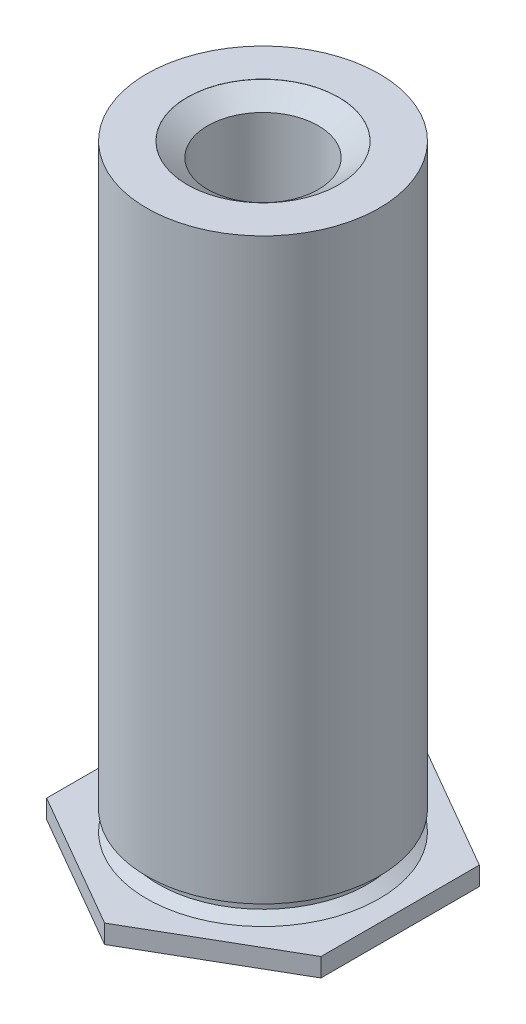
ISO-10303-21;
HEADER;
FILE_DESCRIPTION(('STEP AP214'),'2;1');
FILE_NAME('part.step','',(''),(''),'','','');
FILE_SCHEMA(('AUTOMOTIVE_DESIGN { 1 0 10303 214 1 1 1 1 }'));
ENDSEC;
DATA;
#1=APPLICATION_CONTEXT('core data for automotive mechanical design processes');
#2=APPLICATION_PROTOCOL_DEFINITION('international standard','automotive_design',2000,#1);
#3=PRODUCT_CONTEXT('',#1,'mechanical');
#4=PRODUCT('Part','Part','',(#3));
#5=PRODUCT_RELATED_PRODUCT_CATEGORY('part','',(#4));
#6=PRODUCT_DEFINITION_FORMATION('','',#4);
#7=PRODUCT_DEFINITION_CONTEXT('part definition',#1,'design');
#8=PRODUCT_DEFINITION('design','',#6,#7);
#9=PRODUCT_DEFINITION_SHAPE('','',#8);
#10=(LENGTH_UNIT() NAMED_UNIT(*) SI_UNIT(.MILLI.,.METRE.));
#11=(NAMED_UNIT(*) PLANE_ANGLE_UNIT() SI_UNIT($,.RADIAN.));
#12=(NAMED_UNIT(*) SI_UNIT($,.STERADIAN.) SOLID_ANGLE_UNIT());
#13=UNCERTAINTY_MEASURE_WITH_UNIT(LENGTH_MEASURE(1.E-05),#10,'distance_accuracy_value','');
#14=(GEOMETRIC_REPRESENTATION_CONTEXT(3) GLOBAL_UNCERTAINTY_ASSIGNED_CONTEXT((#13)) GLOBAL_UNIT_ASSIGNED_CONTEXT((#10,
#11,#12)) REPRESENTATION_CONTEXT('',''));
#15=CARTESIAN_POINT('',(0.,0.,0.));
#16=DIRECTION('',(0.,0.,1.));
#17=DIRECTION('',(1.,0.,0.));
#18=AXIS2_PLACEMENT_3D('',#15,#16,#17);
#19=CARTESIAN_POINT('',(3.683,0.430784,0.));
#20=DIRECTION('',(0.,1.,0.));
#21=DIRECTION('',(0.,0.,1.));
#22=AXIS2_PLACEMENT_3D('',#19,#20,#21);
#23=PLANE('',#22);
#24=CARTESIAN_POINT('',(0.,0.430784,0.));
#25=DIRECTION('',(0.,-1.,0.));
#26=DIRECTION('',(0.,0.,-1.));
#27=AXIS2_PLACEMENT_3D('',#24,#25,#26);
#28=CIRCLE('',#27,2.6924);
#29=CARTESIAN_POINT('',(0.,0.430784,-2.6924));
#30=VERTEX_POINT('',#29);
#31=EDGE_CURVE('E11',#30,#30,#28,.T.);
#32=ORIENTED_EDGE('',*,*,#31,.T.);
#33=EDGE_LOOP('',(#32));
#34=FACE_BOUND('',#33,.T.);
#35=DIRECTION('',(0.866025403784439,0.,0.5));
#36=VECTOR('',#35,1.);
#37=CARTESIAN_POINT('',(0.,0.430784,3.66617420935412));
#38=LINE('',#37,#36);
#39=CARTESIAN_POINT('',(-3.175,0.430784,1.83308710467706));
#40=VERTEX_POINT('',#39);
#41=CARTESIAN_POINT('',(0.,0.430784,3.66617420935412));
#42=VERTEX_POINT('',#41);
#43=EDGE_CURVE('E137',#40,#42,#38,.T.);
#44=ORIENTED_EDGE('',*,*,#43,.T.);
#45=DIRECTION('',(0.866025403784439,0.,-0.5));
#46=VECTOR('',#45,1.);
#47=CARTESIAN_POINT('',(3.175,0.430784,1.83308710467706));
#48=LINE('',#47,#46);
#49=CARTESIAN_POINT('',(3.175,0.430784,1.83308710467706));
#50=VERTEX_POINT('',#49);
#51=EDGE_CURVE('E126',#42,#50,#48,.T.);
#52=ORIENTED_EDGE('',*,*,#51,.T.);
#53=DIRECTION('',(0.,0.,-1.));
#54=VECTOR('',#53,1.);
#55=CARTESIAN_POINT('',(3.175,0.430784,-1.83308710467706));
#56=LINE('',#55,#54);
#57=CARTESIAN_POINT('',(3.175,0.430784,-1.83308710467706));
#58=VERTEX_POINT('',#57);
#59=EDGE_CURVE('E129',#50,#58,#56,.T.);
#60=ORIENTED_EDGE('',*,*,#59,.T.);
#61=DIRECTION('',(-0.866025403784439,0.,-0.5));
#62=VECTOR('',#61,1.);
#63=CARTESIAN_POINT('',(0.,0.430784,-3.66617420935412));
#64=LINE('',#63,#62);
#65=CARTESIAN_POINT('',(0.,0.430784,-3.66617420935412));
#66=VERTEX_POINT('',#65);
#67=EDGE_CURVE('E54',#58,#66,#64,.T.);
#68=ORIENTED_EDGE('',*,*,#67,.T.);
#69=DIRECTION('',(-0.866025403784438,0.,0.5));
#70=VECTOR('',#69,1.);
#71=CARTESIAN_POINT('',(-3.175,0.430784,-1.83308710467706));
#72=LINE('',#71,#70);
#73=CARTESIAN_POINT('',(-3.175,0.430784,-1.83308710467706));
#74=VERTEX_POINT('',#73);
#75=EDGE_CURVE('E102',#66,#74,#72,.T.);
#76=ORIENTED_EDGE('',*,*,#75,.T.);
#77=DIRECTION('',(0.,0.,1.));
#78=VECTOR('',#77,1.);
#79=CARTESIAN_POINT('',(-3.175,0.430784,1.83308710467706));
#80=LINE('',#79,#78);
#81=EDGE_CURVE('E134',#74,#40,#80,.T.);
#82=ORIENTED_EDGE('',*,*,#81,.T.);
#83=EDGE_LOOP('',(#44,#52,#60,#68,#76,#82));
#84=FACE_BOUND('',#83,.T.);
#85=ADVANCED_FACE('F39',(#34,#84),#23,.T.);
#86=CARTESIAN_POINT('',(0.,0.430784,0.));
#87=DIRECTION('',(0.,-1.,0.));
#88=DIRECTION('',(0.,0.,-1.));
#89=AXIS2_PLACEMENT_3D('',#86,#87,#88);
#90=CONICAL_SURFACE('',#89,2.6924,1.0471975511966);
#91=CARTESIAN_POINT('',(0.,0.586229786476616,0.));
#92=DIRECTION('',(0.,-1.,0.));
#93=DIRECTION('',(0.,0.,-1.));
#94=AXIS2_PLACEMENT_3D('',#91,#92,#93);
#95=CIRCLE('',#94,2.42316);
#96=CARTESIAN_POINT('',(0.,0.586229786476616,-2.42316));
#97=VERTEX_POINT('',#96);
#98=EDGE_CURVE('E47',#97,#97,#95,.T.);
#99=ORIENTED_EDGE('',*,*,#98,.T.);
#100=EDGE_LOOP('',(#99));
#101=FACE_BOUND('',#100,.T.);
#102=ORIENTED_EDGE('',*,*,#31,.F.);
#103=EDGE_LOOP('',(#102));
#104=FACE_BOUND('',#103,.T.);
#105=ADVANCED_FACE('F177',(#101,#104),#90,.T.);
#106=CARTESIAN_POINT('',(0.,0.,0.));
#107=DIRECTION('',(0.,-1.,0.));
#108=DIRECTION('',(0.,0.,-1.));
#109=AXIS2_PLACEMENT_3D('',#106,#107,#108);
#110=CYLINDRICAL_SURFACE('',#109,2.42316);
#111=CARTESIAN_POINT('',(0.,0.8831072,0.));
#112=DIRECTION('',(0.,-1.,0.));
#113=DIRECTION('',(0.,0.,-1.));
#114=AXIS2_PLACEMENT_3D('',#111,#112,#113);
#115=CIRCLE('',#114,2.42316);
#116=CARTESIAN_POINT('',(0.,0.8831072,-2.42316));
#117=VERTEX_POINT('',#116);
#118=EDGE_CURVE('E171',#117,#117,#115,.T.);
#119=ORIENTED_EDGE('',*,*,#118,.T.);
#120=EDGE_LOOP('',(#119));
#121=FACE_BOUND('',#120,.T.);
#122=ORIENTED_EDGE('',*,*,#98,.F.);
#123=EDGE_LOOP('',(#122));
#124=FACE_BOUND('',#123,.T.);
#125=ADVANCED_FACE('F180',(#121,#124),#110,.T.);
#126=CARTESIAN_POINT('',(2.6924,0.8831072,0.));
#127=DIRECTION('',(0.,-1.,0.));
#128=DIRECTION('',(0.,0.,-1.));
#129=AXIS2_PLACEMENT_3D('',#126,#127,#128);
#130=PLANE('',#129);
#131=CARTESIAN_POINT('',(0.,0.8831072,0.));
#132=DIRECTION('',(0.,-1.,0.));
#133=DIRECTION('',(0.,0.,-1.));
#134=AXIS2_PLACEMENT_3D('',#131,#132,#133);
#135=CIRCLE('',#134,2.6924);
#136=CARTESIAN_POINT('',(0.,0.8831072,-2.6924));
#137=VERTEX_POINT('',#136);
#138=EDGE_CURVE('E168',#137,#137,#135,.T.);
#139=ORIENTED_EDGE('',*,*,#138,.T.);
#140=EDGE_LOOP('',(#139));
#141=FACE_BOUND('',#140,.T.);
#142=ORIENTED_EDGE('',*,*,#118,.F.);
#143=EDGE_LOOP('',(#142));
#144=FACE_BOUND('',#143,.T.);
#145=ADVANCED_FACE('F182',(#141,#144),#130,.T.);
#146=CARTESIAN_POINT('',(0.,0.,0.));
#147=DIRECTION('',(0.,-1.,0.));
#148=DIRECTION('',(0.,0.,-1.));
#149=AXIS2_PLACEMENT_3D('',#146,#147,#148);
#150=CYLINDRICAL_SURFACE('',#149,2.6924);
#151=CARTESIAN_POINT('',(0.,14.2748,0.));
#152=DIRECTION('',(0.,-1.,0.));
#153=DIRECTION('',(0.,0.,-1.));
#154=AXIS2_PLACEMENT_3D('',#151,#152,#153);
#155=CIRCLE('',#154,2.6924);
#156=CARTESIAN_POINT('',(0.,14.2748,-2.6924));
#157=VERTEX_POINT('',#156);
#158=EDGE_CURVE('E165',#157,#157,#155,.T.);
#159=ORIENTED_EDGE('',*,*,#158,.T.);
#160=EDGE_LOOP('',(#159));
#161=FACE_BOUND('',#160,.T.);
#162=ORIENTED_EDGE('',*,*,#138,.F.);
#163=EDGE_LOOP('',(#162));
#164=FACE_BOUND('',#163,.T.);
#165=ADVANCED_FACE('F189',(#161,#164),#150,.T.);
#166=CARTESIAN_POINT('',(2.6924,14.2748,0.));
#167=DIRECTION('',(0.,1.,0.));
#168=DIRECTION('',(0.,0.,1.));
#169=AXIS2_PLACEMENT_3D('',#166,#167,#168);
#170=PLANE('',#169);
#171=CARTESIAN_POINT('',(0.,14.2748,0.));
#172=DIRECTION('',(0.,1.,0.));
#173=DIRECTION('',(0.,0.,1.));
#174=AXIS2_PLACEMENT_3D('',#171,#172,#173);
#175=CIRCLE('',#174,1.75514);
#176=CARTESIAN_POINT('',(0.,14.2748,1.75514));
#177=VERTEX_POINT('',#176);
#178=EDGE_CURVE('E42',#177,#177,#175,.T.);
#179=ORIENTED_EDGE('',*,*,#178,.F.);
#180=EDGE_LOOP('',(#179));
#181=FACE_BOUND('',#180,.T.);
#182=ORIENTED_EDGE('',*,*,#158,.F.);
#183=EDGE_LOOP('',(#182));
#184=FACE_BOUND('',#183,.T.);
#185=ADVANCED_FACE('F238',(#181,#184),#170,.T.);
#186=CARTESIAN_POINT('',(1.75514,14.27226,0.));
#187=DIRECTION('',(0.,-1.,0.));
#188=DIRECTION('',(0.,0.,-1.));
#189=AXIS2_PLACEMENT_3D('',#186,#187,#188);
#190=PLANE('',#189);
#191=CARTESIAN_POINT('',(0.,14.27226,0.));
#192=DIRECTION('',(0.,-1.,0.));
#193=DIRECTION('',(0.,0.,-1.));
#194=AXIS2_PLACEMENT_3D('',#191,#192,#193);
#195=CIRCLE('',#194,1.75514);
#196=CARTESIAN_POINT('',(0.,14.27226,-1.75514));
#197=VERTEX_POINT('',#196);
#198=EDGE_CURVE('E142',#197,#197,#195,.T.);
#199=ORIENTED_EDGE('',*,*,#198,.F.);
#200=EDGE_LOOP('',(#199));
#201=FACE_BOUND('',#200,.T.);
#202=CARTESIAN_POINT('',(0.,14.27226,0.));
#203=DIRECTION('',(0.,-1.,0.));
#204=DIRECTION('',(0.,0.,-1.));
#205=AXIS2_PLACEMENT_3D('',#202,#203,#204);
#206=CIRCLE('',#205,1.7526);
#207=CARTESIAN_POINT('',(0.,14.27226,-1.7526));
#208=VERTEX_POINT('',#207);
#209=EDGE_CURVE('E153',#208,#208,#206,.T.);
#210=ORIENTED_EDGE('',*,*,#209,.T.);
#211=EDGE_LOOP('',(#210));
#212=FACE_BOUND('',#211,.T.);
#213=ADVANCED_FACE('F234',(#201,#212),#190,.F.);
#214=CARTESIAN_POINT('',(0.,13.9415768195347,0.));
#215=DIRECTION('',(0.,1.,0.));
#216=DIRECTION('',(0.,0.,1.));
#217=AXIS2_PLACEMENT_3D('',#214,#215,#216);
#218=CONICAL_SURFACE('',#217,1.28016,0.960105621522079);
#219=ORIENTED_EDGE('',*,*,#209,.F.);
#220=EDGE_LOOP('',(#219));
#221=FACE_BOUND('',#220,.T.);
#222=CARTESIAN_POINT('',(0.,13.9415768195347,0.));
#223=DIRECTION('',(0.,-1.,0.));
#224=DIRECTION('',(0.,0.,-1.));
#225=AXIS2_PLACEMENT_3D('',#222,#223,#224);
#226=CIRCLE('',#225,1.28016);
#227=CARTESIAN_POINT('',(0.,13.9415768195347,-1.28016));
#228=VERTEX_POINT('',#227);
#229=EDGE_CURVE('E150',#228,#228,#226,.T.);
#230=ORIENTED_EDGE('',*,*,#229,.T.);
#231=EDGE_LOOP('',(#230));
#232=FACE_BOUND('',#231,.T.);
#233=ADVANCED_FACE('F230',(#221,#232),#218,.F.);
#234=CARTESIAN_POINT('',(0.,-2.54,0.));
#235=DIRECTION('',(0.,-1.,0.));
#236=DIRECTION('',(0.,0.,-1.));
#237=AXIS2_PLACEMENT_3D('',#234,#235,#236);
#238=CYLINDRICAL_SURFACE('',#237,1.75514);
#239=ORIENTED_EDGE('',*,*,#178,.T.);
#240=EDGE_LOOP('',(#239));
#241=FACE_BOUND('',#240,.T.);
#242=ORIENTED_EDGE('',*,*,#198,.T.);
#243=EDGE_LOOP('',(#242));
#244=FACE_BOUND('',#243,.T.);
#245=ADVANCED_FACE('F226',(#241,#244),#238,.F.);
#246=CARTESIAN_POINT('',(0.,2.92414036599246,0.));
#247=DIRECTION('',(0.,1.,0.));
#248=DIRECTION('',(0.,0.,1.));
#249=AXIS2_PLACEMENT_3D('',#246,#247,#248);
#250=CONICAL_SURFACE('',#249,0.,1.17809724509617);
#251=CARTESIAN_POINT('',(0.,3.4544,0.));
#252=DIRECTION('',(0.,-1.,0.));
#253=DIRECTION('',(0.,0.,-1.));
#254=AXIS2_PLACEMENT_3D('',#251,#252,#253);
#255=CIRCLE('',#254,1.28016);
#256=CARTESIAN_POINT('',(0.,3.4544,-1.28016));
#257=VERTEX_POINT('',#256);
#258=EDGE_CURVE('E156',#257,#257,#255,.T.);
#259=ORIENTED_EDGE('',*,*,#258,.F.);
#260=EDGE_LOOP('',(#259));
#261=FACE_BOUND('',#260,.T.);
#262=CARTESIAN_POINT('',(0.,2.92414036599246,0.));
#263=VERTEX_POINT('',#262);
#264=VERTEX_LOOP('',#263);
#265=FACE_BOUND('',#264,.T.);
#266=ADVANCED_FACE('F229',(#261,#265),#250,.F.);
#267=CARTESIAN_POINT('',(0.,0.,0.));
#268=DIRECTION('',(0.,-1.,0.));
#269=DIRECTION('',(0.,0.,-1.));
#270=AXIS2_PLACEMENT_3D('',#267,#268,#269);
#271=CYLINDRICAL_SURFACE('',#270,1.28016);
#272=ORIENTED_EDGE('',*,*,#229,.F.);
#273=EDGE_LOOP('',(#272));
#274=FACE_BOUND('',#273,.T.);
#275=ORIENTED_EDGE('',*,*,#258,.T.);
#276=EDGE_LOOP('',(#275));
#277=FACE_BOUND('',#276,.T.);
#278=ADVANCED_FACE('F225',(#274,#277),#271,.F.);
#279=CARTESIAN_POINT('',(3.175,0.,1.83308710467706));
#280=DIRECTION('',(0.5,0.,0.866025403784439));
#281=DIRECTION('',(0.866025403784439,0.,-0.5));
#282=AXIS2_PLACEMENT_3D('',#279,#280,#281);
#283=PLANE('',#282);
#284=ORIENTED_EDGE('',*,*,#51,.F.);
#285=DIRECTION('',(0.,1.,0.));
#286=VECTOR('',#285,1.);
#287=CARTESIAN_POINT('',(0.,0.,3.66617420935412));
#288=LINE('',#287,#286);
#289=CARTESIAN_POINT('',(0.,0.,3.66617420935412));
#290=VERTEX_POINT('',#289);
#291=EDGE_CURVE('E140',#290,#42,#288,.T.);
#292=ORIENTED_EDGE('',*,*,#291,.F.);
#293=DIRECTION('',(0.866025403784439,0.,-0.5));
#294=VECTOR('',#293,1.);
#295=CARTESIAN_POINT('',(3.175,0.,1.83308710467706));
#296=LINE('',#295,#294);
#297=CARTESIAN_POINT('',(3.175,0.,1.83308710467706));
#298=VERTEX_POINT('',#297);
#299=EDGE_CURVE('E62',#290,#298,#296,.T.);
#300=ORIENTED_EDGE('',*,*,#299,.T.);
#301=DIRECTION('',(0.,1.,0.));
#302=VECTOR('',#301,1.);
#303=CARTESIAN_POINT('',(3.175,0.,1.83308710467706));
#304=LINE('',#303,#302);
#305=EDGE_CURVE('E125',#298,#50,#304,.T.);
#306=ORIENTED_EDGE('',*,*,#305,.T.);
#307=EDGE_LOOP('',(#284,#292,#300,#306));
#308=FACE_BOUND('',#307,.T.);
#309=ADVANCED_FACE('F205',(#308),#283,.T.);
#310=CARTESIAN_POINT('',(0.,0.,3.66617420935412));
#311=DIRECTION('',(-0.5,0.,0.866025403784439));
#312=DIRECTION('',(0.866025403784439,0.,0.5));
#313=AXIS2_PLACEMENT_3D('',#310,#311,#312);
#314=PLANE('',#313);
#315=ORIENTED_EDGE('',*,*,#43,.F.);
#316=DIRECTION('',(0.,1.,0.));
#317=VECTOR('',#316,1.);
#318=CARTESIAN_POINT('',(-3.175,0.,1.83308710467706));
#319=LINE('',#318,#317);
#320=CARTESIAN_POINT('',(-3.175,0.,1.83308710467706));
#321=VERTEX_POINT('',#320);
#322=EDGE_CURVE('E143',#321,#40,#319,.T.);
#323=ORIENTED_EDGE('',*,*,#322,.F.);
#324=DIRECTION('',(0.866025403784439,0.,0.5));
#325=VECTOR('',#324,1.);
#326=CARTESIAN_POINT('',(0.,0.,3.66617420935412));
#327=LINE('',#326,#325);
#328=EDGE_CURVE('E119',#321,#290,#327,.T.);
#329=ORIENTED_EDGE('',*,*,#328,.T.);
#330=ORIENTED_EDGE('',*,*,#291,.T.);
#331=EDGE_LOOP('',(#315,#323,#329,#330));
#332=FACE_BOUND('',#331,.T.);
#333=ADVANCED_FACE('F204',(#332),#314,.T.);
#334=CARTESIAN_POINT('',(-3.175,0.,1.83308710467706));
#335=DIRECTION('',(-1.,0.,0.));
#336=DIRECTION('',(0.,0.,1.));
#337=AXIS2_PLACEMENT_3D('',#334,#335,#336);
#338=PLANE('',#337);
#339=ORIENTED_EDGE('',*,*,#81,.F.);
#340=DIRECTION('',(0.,1.,0.));
#341=VECTOR('',#340,1.);
#342=CARTESIAN_POINT('',(-3.175,0.,-1.83308710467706));
#343=LINE('',#342,#341);
#344=CARTESIAN_POINT('',(-3.175,0.,-1.83308710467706));
#345=VERTEX_POINT('',#344);
#346=EDGE_CURVE('E103',#345,#74,#343,.T.);
#347=ORIENTED_EDGE('',*,*,#346,.F.);
#348=DIRECTION('',(0.,0.,1.));
#349=VECTOR('',#348,1.);
#350=CARTESIAN_POINT('',(-3.175,0.,1.83308710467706));
#351=LINE('',#350,#349);
#352=EDGE_CURVE('E117',#345,#321,#351,.T.);
#353=ORIENTED_EDGE('',*,*,#352,.T.);
#354=ORIENTED_EDGE('',*,*,#322,.T.);
#355=EDGE_LOOP('',(#339,#347,#353,#354));
#356=FACE_BOUND('',#355,.T.);
#357=ADVANCED_FACE('F339',(#356),#338,.T.);
#358=CARTESIAN_POINT('',(-3.175,0.,-1.83308710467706));
#359=DIRECTION('',(-0.5,0.,-0.866025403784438));
#360=DIRECTION('',(-0.866025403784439,0.,0.5));
#361=AXIS2_PLACEMENT_3D('',#358,#359,#360);
#362=PLANE('',#361);
#363=ORIENTED_EDGE('',*,*,#75,.F.);
#364=DIRECTION('',(0.,1.,0.));
#365=VECTOR('',#364,1.);
#366=CARTESIAN_POINT('',(0.,0.,-3.66617420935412));
#367=LINE('',#366,#365);
#368=CARTESIAN_POINT('',(0.,0.,-3.66617420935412));
#369=VERTEX_POINT('',#368);
#370=EDGE_CURVE('E95',#369,#66,#367,.T.);
#371=ORIENTED_EDGE('',*,*,#370,.F.);
#372=DIRECTION('',(-0.866025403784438,0.,0.5));
#373=VECTOR('',#372,1.);
#374=CARTESIAN_POINT('',(-3.175,0.,-1.83308710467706));
#375=LINE('',#374,#373);
#376=EDGE_CURVE('E99',#369,#345,#375,.T.);
#377=ORIENTED_EDGE('',*,*,#376,.T.);
#378=ORIENTED_EDGE('',*,*,#346,.T.);
#379=EDGE_LOOP('',(#363,#371,#377,#378));
#380=FACE_BOUND('',#379,.T.);
#381=ADVANCED_FACE('F97',(#380),#362,.T.);
#382=CARTESIAN_POINT('',(0.,0.,-3.66617420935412));
#383=DIRECTION('',(0.5,0.,-0.866025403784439));
#384=DIRECTION('',(-0.866025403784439,0.,-0.5));
#385=AXIS2_PLACEMENT_3D('',#382,#383,#384);
#386=PLANE('',#385);
#387=ORIENTED_EDGE('',*,*,#67,.F.);
#388=DIRECTION('',(0.,1.,0.));
#389=VECTOR('',#388,1.);
#390=CARTESIAN_POINT('',(3.175,0.,-1.83308710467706));
#391=LINE('',#390,#389);
#392=CARTESIAN_POINT('',(3.175,0.,-1.83308710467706));
#393=VERTEX_POINT('',#392);
#394=EDGE_CURVE('E104',#393,#58,#391,.T.);
#395=ORIENTED_EDGE('',*,*,#394,.F.);
#396=DIRECTION('',(-0.866025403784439,0.,-0.5));
#397=VECTOR('',#396,1.);
#398=CARTESIAN_POINT('',(0.,0.,-3.66617420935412));
#399=LINE('',#398,#397);
#400=EDGE_CURVE('E107',#393,#369,#399,.T.);
#401=ORIENTED_EDGE('',*,*,#400,.T.);
#402=ORIENTED_EDGE('',*,*,#370,.T.);
#403=EDGE_LOOP('',(#387,#395,#401,#402));
#404=FACE_BOUND('',#403,.T.);
#405=ADVANCED_FACE('F108',(#404),#386,.T.);
#406=CARTESIAN_POINT('',(3.175,0.,-1.83308710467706));
#407=DIRECTION('',(1.,0.,0.));
#408=DIRECTION('',(0.,0.,-1.));
#409=AXIS2_PLACEMENT_3D('',#406,#407,#408);
#410=PLANE('',#409);
#411=ORIENTED_EDGE('',*,*,#59,.F.);
#412=ORIENTED_EDGE('',*,*,#305,.F.);
#413=DIRECTION('',(0.,0.,-1.));
#414=VECTOR('',#413,1.);
#415=CARTESIAN_POINT('',(3.175,0.,-1.83308710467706));
#416=LINE('',#415,#414);
#417=EDGE_CURVE('E112',#298,#393,#416,.T.);
#418=ORIENTED_EDGE('',*,*,#417,.T.);
#419=ORIENTED_EDGE('',*,*,#394,.T.);
#420=EDGE_LOOP('',(#411,#412,#418,#419));
#421=FACE_BOUND('',#420,.T.);
#422=ADVANCED_FACE('F208',(#421),#410,.T.);
#423=CARTESIAN_POINT('',(2.6924,0.00253999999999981,0.));
#424=DIRECTION('',(0.,-1.,0.));
#425=DIRECTION('',(0.,0.,-1.));
#426=AXIS2_PLACEMENT_3D('',#423,#424,#425);
#427=PLANE('',#426);
#428=CARTESIAN_POINT('',(0.,0.00254000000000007,0.));
#429=DIRECTION('',(0.,-1.,0.));
#430=DIRECTION('',(0.,0.,-1.));
#431=AXIS2_PLACEMENT_3D('',#428,#429,#430);
#432=CIRCLE('',#431,2.6924);
#433=CARTESIAN_POINT('',(0.,0.00254000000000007,-2.6924));
#434=VERTEX_POINT('',#433);
#435=EDGE_CURVE('E162',#434,#434,#432,.T.);
#436=ORIENTED_EDGE('',*,*,#435,.T.);
#437=EDGE_LOOP('',(#436));
#438=FACE_BOUND('',#437,.T.);
#439=ADVANCED_FACE('F211',(#438),#427,.T.);
#440=CARTESIAN_POINT('',(0.,0.,0.));
#441=DIRECTION('',(0.,-1.,0.));
#442=DIRECTION('',(0.,0.,-1.));
#443=AXIS2_PLACEMENT_3D('',#440,#441,#442);
#444=CYLINDRICAL_SURFACE('',#443,2.6924);
#445=CARTESIAN_POINT('',(0.,0.,0.));
#446=DIRECTION('',(0.,-1.,0.));
#447=DIRECTION('',(0.,0.,-1.));
#448=AXIS2_PLACEMENT_3D('',#445,#446,#447);
#449=CIRCLE('',#448,2.6924);
#450=CARTESIAN_POINT('',(0.,0.,-2.6924));
#451=VERTEX_POINT('',#450);
#452=EDGE_CURVE('E159',#451,#451,#449,.T.);
#453=ORIENTED_EDGE('',*,*,#452,.T.);
#454=EDGE_LOOP('',(#453));
#455=FACE_BOUND('',#454,.T.);
#456=ORIENTED_EDGE('',*,*,#435,.F.);
#457=EDGE_LOOP('',(#456));
#458=FACE_BOUND('',#457,.T.);
#459=ADVANCED_FACE('F218',(#455,#458),#444,.F.);
#460=CARTESIAN_POINT('',(2.6924,0.,0.));
#461=DIRECTION('',(0.,-1.,0.));
#462=DIRECTION('',(0.,0.,-1.));
#463=AXIS2_PLACEMENT_3D('',#460,#461,#462);
#464=PLANE('',#463);
#465=ORIENTED_EDGE('',*,*,#452,.F.);
#466=EDGE_LOOP('',(#465));
#467=FACE_BOUND('',#466,.T.);
#468=ORIENTED_EDGE('',*,*,#417,.F.);
#469=ORIENTED_EDGE('',*,*,#299,.F.);
#470=ORIENTED_EDGE('',*,*,#328,.F.);
#471=ORIENTED_EDGE('',*,*,#352,.F.);
#472=ORIENTED_EDGE('',*,*,#376,.F.);
#473=ORIENTED_EDGE('',*,*,#400,.F.);
#474=EDGE_LOOP('',(#468,#469,#470,#471,#472,#473));
#475=FACE_BOUND('',#474,.T.);
#476=ADVANCED_FACE('F114',(#467,#475),#464,.T.);
#477=CLOSED_SHELL('',(#85,#105,#125,#145,#165,#185,#213,#233,#245,#266,#278,#309,#333,#357,#381,
#405,#422,#439,#459,#476));
#478=MANIFOLD_SOLID_BREP('B2',#477);
#479=ADVANCED_BREP_SHAPE_REPRESENTATION('',(#18,#478),#14);
#480=SHAPE_DEFINITION_REPRESENTATION(#9,#479);
ENDSEC;
END-ISO-10303-21;
